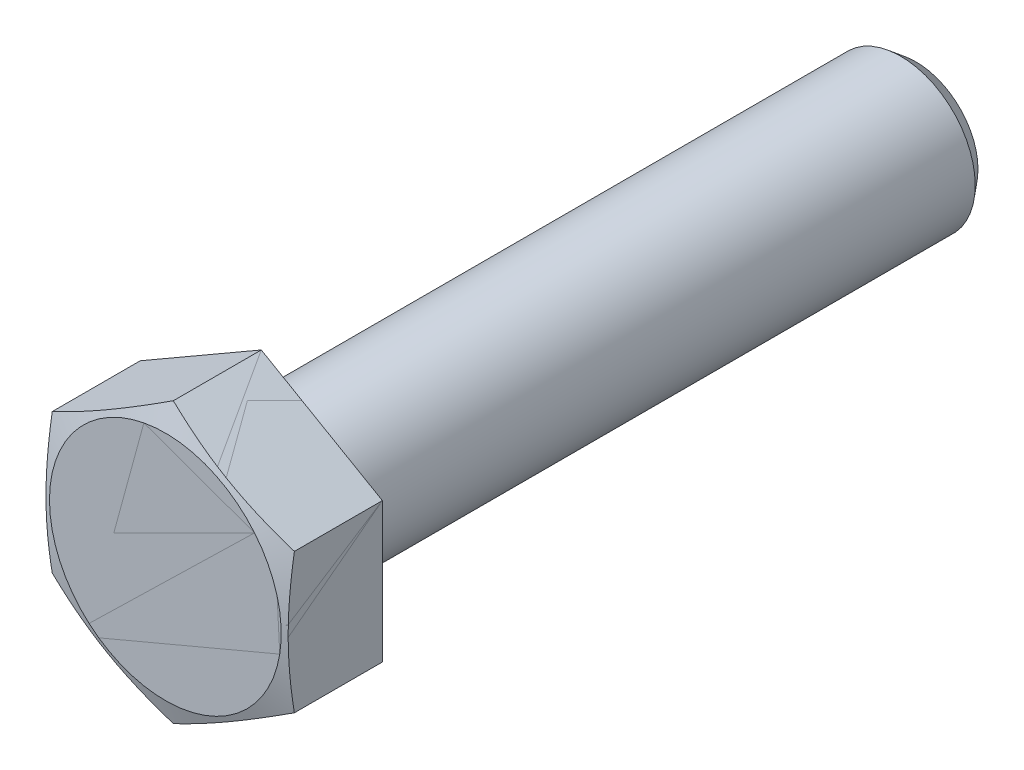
ISO-10303-21;
HEADER;
FILE_DESCRIPTION(('STEP AP214'),'2;1');
FILE_NAME('part.step','',(''),(''),'','','');
FILE_SCHEMA(('AUTOMOTIVE_DESIGN { 1 0 10303 214 1 1 1 1 }'));
ENDSEC;
DATA;
#1=APPLICATION_CONTEXT('core data for automotive mechanical design processes');
#2=APPLICATION_PROTOCOL_DEFINITION('international standard','automotive_design',2000,#1);
#3=PRODUCT_CONTEXT('',#1,'mechanical');
#4=PRODUCT('Part','Part','',(#3));
#5=PRODUCT_RELATED_PRODUCT_CATEGORY('part','',(#4));
#6=PRODUCT_DEFINITION_FORMATION('','',#4);
#7=PRODUCT_DEFINITION_CONTEXT('part definition',#1,'design');
#8=PRODUCT_DEFINITION('design','',#6,#7);
#9=PRODUCT_DEFINITION_SHAPE('','',#8);
#10=(LENGTH_UNIT() NAMED_UNIT(*) SI_UNIT(.MILLI.,.METRE.));
#11=(NAMED_UNIT(*) PLANE_ANGLE_UNIT() SI_UNIT($,.RADIAN.));
#12=(NAMED_UNIT(*) SI_UNIT($,.STERADIAN.) SOLID_ANGLE_UNIT());
#13=UNCERTAINTY_MEASURE_WITH_UNIT(LENGTH_MEASURE(1.E-05),#10,'distance_accuracy_value','');
#14=(GEOMETRIC_REPRESENTATION_CONTEXT(3) GLOBAL_UNCERTAINTY_ASSIGNED_CONTEXT((#13)) GLOBAL_UNIT_ASSIGNED_CONTEXT((#10,
#11,#12)) REPRESENTATION_CONTEXT('',''));
#15=CARTESIAN_POINT('',(0.,0.,0.));
#16=DIRECTION('',(0.,0.,1.));
#17=DIRECTION('',(1.,0.,0.));
#18=AXIS2_PLACEMENT_3D('',#15,#16,#17);
#19=CARTESIAN_POINT('',(0.,0.,0.15));
#20=DIRECTION('',(0.,0.,1.));
#21=DIRECTION('',(1.,0.,0.));
#22=AXIS2_PLACEMENT_3D('',#19,#20,#21);
#23=TOROIDAL_SURFACE('',#22,5.65,0.15);
#24=CARTESIAN_POINT('',(0.,0.,0.15));
#25=DIRECTION('',(0.,0.,1.));
#26=DIRECTION('',(1.,0.,0.));
#27=AXIS2_PLACEMENT_3D('',#24,#25,#26);
#28=CIRCLE('',#27,5.8);
#29=CARTESIAN_POINT('',(5.8,0.,0.15));
#30=VERTEX_POINT('',#29);
#31=EDGE_CURVE('P0_E11',#30,#30,#28,.T.);
#32=ORIENTED_EDGE('',*,*,#31,.F.);
#33=EDGE_LOOP('',(#32));
#34=FACE_BOUND('',#33,.T.);
#35=CARTESIAN_POINT('',(0.,0.,0.));
#36=DIRECTION('',(0.,0.,1.));
#37=DIRECTION('',(1.,0.,0.));
#38=AXIS2_PLACEMENT_3D('',#35,#36,#37);
#39=CIRCLE('',#38,5.65);
#40=CARTESIAN_POINT('',(5.65,0.,0.));
#41=VERTEX_POINT('',#40);
#42=EDGE_CURVE('P0_E33',#41,#41,#39,.T.);
#43=ORIENTED_EDGE('',*,*,#42,.T.);
#44=EDGE_LOOP('',(#43));
#45=FACE_BOUND('',#44,.T.);
#46=ADVANCED_FACE('P0_F26',(#34,#45),#23,.T.);
#47=CARTESIAN_POINT('',(0.,5.65,0.));
#48=DIRECTION('',(0.,0.,-1.));
#49=DIRECTION('',(-1.,0.,0.));
#50=AXIS2_PLACEMENT_3D('',#47,#48,#49);
#51=PLANE('',#50);
#52=CARTESIAN_POINT('',(0.,0.,0.));
#53=DIRECTION('',(0.,0.,1.));
#54=DIRECTION('',(1.,0.,0.));
#55=AXIS2_PLACEMENT_3D('',#52,#53,#54);
#56=CIRCLE('',#55,4.4);
#57=CARTESIAN_POINT('',(4.4,0.,0.));
#58=VERTEX_POINT('',#57);
#59=EDGE_CURVE('P0_E118',#58,#58,#56,.T.);
#60=ORIENTED_EDGE('',*,*,#59,.T.);
#61=EDGE_LOOP('',(#60));
#62=FACE_BOUND('',#61,.T.);
#63=ORIENTED_EDGE('',*,*,#42,.F.);
#64=EDGE_LOOP('',(#63));
#65=FACE_BOUND('',#64,.T.);
#66=ADVANCED_FACE('P0_F124',(#62,#65),#51,.T.);
#67=CARTESIAN_POINT('',(0.,0.,-0.4));
#68=DIRECTION('',(0.,0.,1.));
#69=DIRECTION('',(1.,0.,0.));
#70=AXIS2_PLACEMENT_3D('',#67,#68,#69);
#71=TOROIDAL_SURFACE('',#70,4.4,0.4);
#72=CARTESIAN_POINT('',(0.,0.,-0.4));
#73=DIRECTION('',(0.,0.,1.));
#74=DIRECTION('',(1.,0.,0.));
#75=AXIS2_PLACEMENT_3D('',#72,#73,#74);
#76=CIRCLE('',#75,4.);
#77=CARTESIAN_POINT('',(4.,0.,-0.4));
#78=VERTEX_POINT('',#77);
#79=EDGE_CURVE('P0_E115',#78,#78,#76,.T.);
#80=ORIENTED_EDGE('',*,*,#79,.T.);
#81=EDGE_LOOP('',(#80));
#82=FACE_BOUND('',#81,.T.);
#83=ORIENTED_EDGE('',*,*,#59,.F.);
#84=EDGE_LOOP('',(#83));
#85=FACE_BOUND('',#84,.T.);
#86=ADVANCED_FACE('P0_F126',(#82,#85),#71,.F.);
#87=CARTESIAN_POINT('',(-6.5,-3.752775,0.15));
#88=DIRECTION('',(0.,0.,-1.));
#89=DIRECTION('',(-1.,0.,0.));
#90=AXIS2_PLACEMENT_3D('',#87,#88,#89);
#91=PLANE('',#90);
#92=DIRECTION('',(0.,-1.,0.));
#93=VECTOR('',#92,1.);
#94=CARTESIAN_POINT('',(-6.5,3.752775,0.15));
#95=LINE('',#94,#93);
#96=CARTESIAN_POINT('',(-6.5,3.752775,0.15));
#97=VERTEX_POINT('',#96);
#98=CARTESIAN_POINT('',(-6.5,-3.752775,0.15));
#99=VERTEX_POINT('',#98);
#100=EDGE_CURVE('P0_E92',#97,#99,#95,.T.);
#101=ORIENTED_EDGE('',*,*,#100,.F.);
#102=DIRECTION('',(0.866025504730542,0.499999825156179,0.));
#103=VECTOR('',#102,1.);
#104=CARTESIAN_POINT('',(-6.5,3.752775,0.15));
#105=LINE('',#104,#103);
#106=CARTESIAN_POINT('',(0.,7.50555,0.15));
#107=VERTEX_POINT('',#106);
#108=EDGE_CURVE('P0_E97',#97,#107,#105,.T.);
#109=ORIENTED_EDGE('',*,*,#108,.T.);
#110=DIRECTION('',(0.866025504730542,-0.499999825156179,0.));
#111=VECTOR('',#110,1.);
#112=CARTESIAN_POINT('',(0.,7.50555,0.15));
#113=LINE('',#112,#111);
#114=CARTESIAN_POINT('',(6.5,3.752775,0.15));
#115=VERTEX_POINT('',#114);
#116=EDGE_CURVE('P0_E103',#107,#115,#113,.T.);
#117=ORIENTED_EDGE('',*,*,#116,.T.);
#118=DIRECTION('',(0.,-1.,0.));
#119=VECTOR('',#118,1.);
#120=CARTESIAN_POINT('',(6.5,3.752775,0.15));
#121=LINE('',#120,#119);
#122=CARTESIAN_POINT('',(6.5,-3.752775,0.15));
#123=VERTEX_POINT('',#122);
#124=EDGE_CURVE('P0_E233',#115,#123,#121,.T.);
#125=ORIENTED_EDGE('',*,*,#124,.T.);
#126=DIRECTION('',(-0.866025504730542,-0.499999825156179,0.));
#127=VECTOR('',#126,1.);
#128=CARTESIAN_POINT('',(6.5,-3.752775,0.15));
#129=LINE('',#128,#127);
#130=CARTESIAN_POINT('',(0.,-7.50555,0.15));
#131=VERTEX_POINT('',#130);
#132=EDGE_CURVE('P0_E219',#123,#131,#129,.T.);
#133=ORIENTED_EDGE('',*,*,#132,.T.);
#134=DIRECTION('',(-0.866025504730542,0.499999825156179,0.));
#135=VECTOR('',#134,1.);
#136=CARTESIAN_POINT('',(0.,-7.50555,0.15));
#137=LINE('',#136,#135);
#138=EDGE_CURVE('P0_E217',#131,#99,#137,.T.);
#139=ORIENTED_EDGE('',*,*,#138,.T.);
#140=EDGE_LOOP('',(#101,#109,#117,#125,#133,#139));
#141=FACE_BOUND('',#140,.T.);
#142=ORIENTED_EDGE('',*,*,#31,.T.);
#143=EDGE_LOOP('',(#142));
#144=FACE_BOUND('',#143,.T.);
#145=ADVANCED_FACE('P0_F132',(#141,#144),#91,.T.);
#146=CARTESIAN_POINT('',(-6.5,3.752775,0.15));
#147=DIRECTION('',(-1.,0.,0.));
#148=DIRECTION('',(0.,0.,1.));
#149=AXIS2_PLACEMENT_3D('',#146,#147,#148);
#150=PLANE('',#149);
#151=CARTESIAN_POINT('',(-6.5,-9.92768465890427,3.42219076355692));
#152=CARTESIAN_POINT('',(-6.5,-9.63320200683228,3.50410507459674));
#153=CARTESIAN_POINT('',(-6.5,-9.33844353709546,3.58504584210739));
#154=CARTESIAN_POINT('',(-6.5,-8.74823643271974,3.74444577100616));
#155=CARTESIAN_POINT('',(-6.5,-8.45278775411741,3.82290476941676));
#156=CARTESIAN_POINT('',(-6.5,-7.86064924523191,3.97691306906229));
#157=CARTESIAN_POINT('',(-6.5,-7.56395820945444,4.05245775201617));
#158=CARTESIAN_POINT('',(-6.5,-6.96964246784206,4.19977756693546));
#159=CARTESIAN_POINT('',(-6.5,-6.67201777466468,4.27155274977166));
#160=CARTESIAN_POINT('',(-6.5,-6.07920080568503,4.40958972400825));
#161=CARTESIAN_POINT('',(-6.5,-5.78402145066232,4.47590673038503));
#162=CARTESIAN_POINT('',(-6.5,-5.19244039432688,4.60283348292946));
#163=CARTESIAN_POINT('',(-6.5,-4.89603873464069,4.66344342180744));
#164=CARTESIAN_POINT('',(-6.5,-4.30192301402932,4.77756540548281));
#165=CARTESIAN_POINT('',(-6.5,-4.00420923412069,4.83107890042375));
#166=CARTESIAN_POINT('',(-6.5,-3.4073313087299,4.92939310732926));
#167=CARTESIAN_POINT('',(-6.5,-3.10816717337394,4.9741938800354));
#168=CARTESIAN_POINT('',(-6.5,-2.51584786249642,5.05231938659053));
#169=CARTESIAN_POINT('',(-6.5,-2.22272695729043,5.08590043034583));
#170=CARTESIAN_POINT('',(-6.5,-1.6353790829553,5.14147194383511));
#171=CARTESIAN_POINT('',(-6.5,-1.34115215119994,5.16346280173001));
#172=CARTESIAN_POINT('',(-6.5,-0.752211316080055,5.19459534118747));
#173=CARTESIAN_POINT('',(-6.5,-0.457497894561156,5.20374596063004));
#174=CARTESIAN_POINT('',(-6.5,0.132041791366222,5.20865235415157));
#175=CARTESIAN_POINT('',(-6.5,0.426868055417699,5.20440817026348));
#176=CARTESIAN_POINT('',(-6.5,1.01755930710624,5.18273935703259));
#177=CARTESIAN_POINT('',(-6.5,1.31342173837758,5.16524639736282));
#178=CARTESIAN_POINT('',(-6.5,1.90416213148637,5.11804868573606));
#179=CARTESIAN_POINT('',(-6.5,2.19904006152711,5.08834354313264));
#180=CARTESIAN_POINT('',(-6.5,2.78778899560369,5.01822295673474));
#181=CARTESIAN_POINT('',(-6.5,3.08165875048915,4.97779718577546));
#182=CARTESIAN_POINT('',(-6.5,3.66800309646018,4.88794282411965));
#183=CARTESIAN_POINT('',(-6.5,3.96047768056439,4.83851418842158));
#184=CARTESIAN_POINT('',(-6.5,4.53383951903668,4.734123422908));
#185=CARTESIAN_POINT('',(-6.5,4.81477360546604,4.67941596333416));
#186=CARTESIAN_POINT('',(-6.5,5.37549299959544,4.56437238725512));
#187=CARTESIAN_POINT('',(-6.5,5.65527825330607,4.50403600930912));
#188=CARTESIAN_POINT('',(-6.5,6.21386077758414,4.3787797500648));
#189=CARTESIAN_POINT('',(-6.5,6.49265788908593,4.31385916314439));
#190=CARTESIAN_POINT('',(-6.5,7.0493618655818,4.18029589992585));
#191=CARTESIAN_POINT('',(-6.5,7.3272687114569,4.11165314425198));
#192=CARTESIAN_POINT('',(-6.5,7.88244293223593,3.97129958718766));
#193=CARTESIAN_POINT('',(-6.5,8.159709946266,3.89958736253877));
#194=CARTESIAN_POINT('',(-6.5,8.71358713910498,3.75366585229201));
#195=CARTESIAN_POINT('',(-6.5,8.99019731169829,3.67945654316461));
#196=CARTESIAN_POINT('',(-6.5,9.81912857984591,3.45377511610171));
#197=CARTESIAN_POINT('',(-6.5,10.3706135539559,3.29923331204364));
#198=CARTESIAN_POINT('',(-6.5,11.4645427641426,2.98659237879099));
#199=CARTESIAN_POINT('',(-6.5,12.0070088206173,2.82856906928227));
#200=CARTESIAN_POINT('',(-6.5,13.090775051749,2.5085206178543));
#201=CARTESIAN_POINT('',(-6.5,13.6320751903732,2.34649535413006));
#202=CARTESIAN_POINT('',(-6.5,14.7126438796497,2.01984553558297));
#203=CARTESIAN_POINT('',(-6.5,15.2519143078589,1.85522717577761));
#204=CARTESIAN_POINT('',(-6.5,16.3297306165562,1.52373570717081));
#205=CARTESIAN_POINT('',(-6.5,16.8682765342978,1.3568627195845));
#206=CARTESIAN_POINT('',(-6.5,17.4065709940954,1.18919184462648));
#207=B_SPLINE_CURVE_WITH_KNOTS('',3,(#151,#152,#153,#154,#155,#156,#157,#158,#159,#160,#161,
#162,#163,#164,#165,#166,#167,#168,#169,#170,#171,#172,#173,#174,#175,#176,#177,#178,#179,#180,
#181,#182,#183,#184,#185,#186,#187,#188,#189,#190,#191,#192,#193,#194,#195,#196,#197,#198,#199,
#200,#201,#202,#203,#204,#205,#206),.UNSPECIFIED.,.F.,.F.,(4,2,2,2,2,2,2,2,2,2,2,2,2,2,2,2,2,2,
2,2,2,2,2,2,2,2,2,4),(0.,0.916995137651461,1.83405036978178,2.75250368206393,3.67094459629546,
4.57851158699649,5.48604792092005,6.39339851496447,7.30074278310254,8.18565759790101,
9.07054277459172,9.95481169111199,10.8390778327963,11.7279358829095,12.616822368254,
13.5065682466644,14.3963185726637,15.2548833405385,16.1134880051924,16.9722251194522,
17.830980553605,18.6901385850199,19.5493047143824,21.2674414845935,22.9624656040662,
24.6575413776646,26.3490461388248,28.0404603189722),.UNSPECIFIED.);
#208=CARTESIAN_POINT('',(-6.5,3.752775,4.87245657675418));
#209=VERTEX_POINT('',#208);
#210=CARTESIAN_POINT('',(-6.5,-3.752775,4.87245657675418));
#211=VERTEX_POINT('',#210);
#212=EDGE_CURVE('P0_E81',#209,#211,#207,.F.);
#213=ORIENTED_EDGE('',*,*,#212,.F.);
#214=DIRECTION('',(0.,0.,1.));
#215=VECTOR('',#214,1.);
#216=CARTESIAN_POINT('',(-6.5,3.752775,0.15));
#217=LINE('',#216,#215);
#218=EDGE_CURVE('P0_E90',#97,#209,#217,.T.);
#219=ORIENTED_EDGE('',*,*,#218,.F.);
#220=ORIENTED_EDGE('',*,*,#100,.T.);
#221=DIRECTION('',(0.,0.,1.));
#222=VECTOR('',#221,1.);
#223=CARTESIAN_POINT('',(-6.5,-3.752775,0.15));
#224=LINE('',#223,#222);
#225=EDGE_CURVE('P0_E48',#99,#211,#224,.T.);
#226=ORIENTED_EDGE('',*,*,#225,.T.);
#227=EDGE_LOOP('',(#213,#219,#220,#226));
#228=FACE_BOUND('',#227,.T.);
#229=ADVANCED_FACE('P0_F88',(#228),#150,.T.);
#230=CARTESIAN_POINT('',(0.,-7.50555,0.15));
#231=DIRECTION('',(0.499999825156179,0.866025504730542,0.));
#232=DIRECTION('',(0.866025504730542,-0.499999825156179,0.));
#233=AXIS2_PLACEMENT_3D('',#230,#231,#232);
#234=PLANE('',#233);
#235=DIRECTION('',(0.,0.,1.));
#236=VECTOR('',#235,1.);
#237=CARTESIAN_POINT('',(0.,-7.50555,0.15));
#238=LINE('',#237,#236);
#239=CARTESIAN_POINT('',(0.,-7.50555,4.87245744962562));
#240=VERTEX_POINT('',#239);
#241=EDGE_CURVE('P0_E224',#131,#240,#238,.T.);
#242=ORIENTED_EDGE('',*,*,#241,.T.);
#243=CARTESIAN_POINT('',(2.00000000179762E-07,-7.50555011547,4.87245741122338));
#244=CARTESIAN_POINT('',(-0.269447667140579,-7.34998438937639,4.92421240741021));
#245=CARTESIAN_POINT('',(-0.539641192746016,-7.19398815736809,4.97125826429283));
#246=CARTESIAN_POINT('',(-1.08149605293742,-6.88114825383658,5.05398662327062));
#247=CARTESIAN_POINT('',(-1.35315821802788,-6.7243041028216,5.0896618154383));
#248=CARTESIAN_POINT('',(-1.89542621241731,-6.41122567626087,5.14740289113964));
#249=CARTESIAN_POINT('',(-2.16602338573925,-6.25499639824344,5.16957424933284));
#250=CARTESIAN_POINT('',(-2.7077471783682,-5.94223216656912,5.19930920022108));
#251=CARTESIAN_POINT('',(-2.97887360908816,-5.78569732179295,5.20687728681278));
#252=CARTESIAN_POINT('',(-3.52112646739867,-5.47262763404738,5.2068772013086));
#253=CARTESIAN_POINT('',(-3.79225289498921,-5.31609279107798,5.19930902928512));
#254=CARTESIAN_POINT('',(-4.33397667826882,-5.00332856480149,5.16957391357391));
#255=CARTESIAN_POINT('',(-4.60457384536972,-4.84709929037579,5.14740247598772));
#256=CARTESIAN_POINT('',(-5.14684182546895,-4.5340208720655,5.08966125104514));
#257=CARTESIAN_POINT('',(-5.41850398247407,-4.37717672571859,5.05398598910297));
#258=CARTESIAN_POINT('',(-5.96035882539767,-4.06433683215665,4.97125750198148));
#259=CARTESIAN_POINT('',(-6.23055234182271,-3.90834060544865,4.92421158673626));
#260=CARTESIAN_POINT('',(-6.5000002,-3.75277488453,4.87245653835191));
#261=B_SPLINE_CURVE_WITH_KNOTS('',3,(#243,#244,#245,#246,#247,#248,#249,#250,#251,#252,#253,
#254,#255,#256,#257,#258,#259,#260),.UNSPECIFIED.,.F.,.F.,(4,2,2,2,2,2,2,2,4),(0.,
0.946299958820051,1.89320704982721,2.83261995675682,3.7717437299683,4.71086749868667,
5.65028040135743,6.59718748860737,7.54348744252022),.UNSPECIFIED.);
#262=EDGE_CURVE('P0_E93',#240,#211,#261,.T.);
#263=ORIENTED_EDGE('',*,*,#262,.T.);
#264=ORIENTED_EDGE('',*,*,#225,.F.);
#265=ORIENTED_EDGE('',*,*,#138,.F.);
#266=EDGE_LOOP('',(#242,#263,#264,#265));
#267=FACE_BOUND('',#266,.T.);
#268=ADVANCED_FACE('P0_F153',(#267),#234,.F.);
#269=CARTESIAN_POINT('',(6.5,-3.752775,0.15));
#270=DIRECTION('',(-0.499999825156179,0.866025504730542,0.));
#271=DIRECTION('',(0.866025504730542,0.499999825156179,0.));
#272=AXIS2_PLACEMENT_3D('',#269,#270,#271);
#273=PLANE('',#272);
#274=DIRECTION('',(0.,0.,1.));
#275=VECTOR('',#274,1.);
#276=CARTESIAN_POINT('',(6.5,-3.752775,0.15));
#277=LINE('',#276,#275);
#278=CARTESIAN_POINT('',(6.5,-3.752775,4.87245657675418));
#279=VERTEX_POINT('',#278);
#280=EDGE_CURVE('P0_E227',#123,#279,#277,.T.);
#281=ORIENTED_EDGE('',*,*,#280,.T.);
#282=CARTESIAN_POINT('',(6.5000002,-3.75277488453,4.87245653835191));
#283=CARTESIAN_POINT('',(6.23055234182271,-3.90834060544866,4.92421158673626));
#284=CARTESIAN_POINT('',(5.96035882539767,-4.06433683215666,4.97125750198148));
#285=CARTESIAN_POINT('',(5.41850398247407,-4.37717672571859,5.05398598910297));
#286=CARTESIAN_POINT('',(5.14684182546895,-4.5340208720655,5.08966125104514));
#287=CARTESIAN_POINT('',(4.60457384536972,-4.84709929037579,5.14740247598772));
#288=CARTESIAN_POINT('',(4.33397667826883,-5.00332856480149,5.16957391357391));
#289=CARTESIAN_POINT('',(3.79225289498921,-5.31609279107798,5.19930902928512));
#290=CARTESIAN_POINT('',(3.52112646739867,-5.47262763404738,5.20687720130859));
#291=CARTESIAN_POINT('',(2.97887360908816,-5.78569732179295,5.20687728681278));
#292=CARTESIAN_POINT('',(2.7077471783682,-5.94223216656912,5.19930920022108));
#293=CARTESIAN_POINT('',(2.16602338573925,-6.25499639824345,5.16957424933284));
#294=CARTESIAN_POINT('',(1.89542621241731,-6.41122567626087,5.14740289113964));
#295=CARTESIAN_POINT('',(1.35315821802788,-6.72430410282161,5.0896618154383));
#296=CARTESIAN_POINT('',(1.08149605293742,-6.88114825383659,5.05398662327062));
#297=CARTESIAN_POINT('',(0.539641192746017,-7.19398815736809,4.97125826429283));
#298=CARTESIAN_POINT('',(0.269447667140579,-7.34998438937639,4.92421240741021));
#299=CARTESIAN_POINT('',(-2.00000001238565E-07,-7.50555011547,4.87245741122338));
#300=B_SPLINE_CURVE_WITH_KNOTS('',3,(#282,#283,#284,#285,#286,#287,#288,#289,#290,#291,#292,
#293,#294,#295,#296,#297,#298,#299),.UNSPECIFIED.,.F.,.F.,(4,2,2,2,2,2,2,2,4),(0.,
0.94629995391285,1.89320704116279,2.83261994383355,3.77174371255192,4.7108674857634,
5.65028039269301,6.59718748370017,7.54348744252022),.UNSPECIFIED.);
#301=EDGE_CURVE('P0_E190',#279,#240,#300,.T.);
#302=ORIENTED_EDGE('',*,*,#301,.T.);
#303=ORIENTED_EDGE('',*,*,#241,.F.);
#304=ORIENTED_EDGE('',*,*,#132,.F.);
#305=EDGE_LOOP('',(#281,#302,#303,#304));
#306=FACE_BOUND('',#305,.T.);
#307=ADVANCED_FACE('P0_F195',(#306),#273,.F.);
#308=CARTESIAN_POINT('',(6.5,3.752775,0.15));
#309=DIRECTION('',(-1.,0.,0.));
#310=DIRECTION('',(0.,0.,1.));
#311=AXIS2_PLACEMENT_3D('',#308,#309,#310);
#312=PLANE('',#311);
#313=DIRECTION('',(0.,0.,1.));
#314=VECTOR('',#313,1.);
#315=CARTESIAN_POINT('',(6.5,3.752775,0.15));
#316=LINE('',#315,#314);
#317=CARTESIAN_POINT('',(6.5,3.752775,4.87245657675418));
#318=VERTEX_POINT('',#317);
#319=EDGE_CURVE('P0_E101',#115,#318,#316,.T.);
#320=ORIENTED_EDGE('',*,*,#319,.T.);
#321=CARTESIAN_POINT('',(6.5,-9.92768465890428,3.42219076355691));
#322=CARTESIAN_POINT('',(6.5,-9.63320200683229,3.50410507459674));
#323=CARTESIAN_POINT('',(6.5,-9.33844353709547,3.58504584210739));
#324=CARTESIAN_POINT('',(6.5,-8.74823643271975,3.74444577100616));
#325=CARTESIAN_POINT('',(6.5,-8.45278775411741,3.82290476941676));
#326=CARTESIAN_POINT('',(6.5,-7.86064924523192,3.97691306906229));
#327=CARTESIAN_POINT('',(6.5,-7.56395820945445,4.05245775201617));
#328=CARTESIAN_POINT('',(6.5,-6.96964246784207,4.19977756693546));
#329=CARTESIAN_POINT('',(6.5,-6.67201777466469,4.27155274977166));
#330=CARTESIAN_POINT('',(6.5,-6.07920080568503,4.40958972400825));
#331=CARTESIAN_POINT('',(6.5,-5.78402145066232,4.47590673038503));
#332=CARTESIAN_POINT('',(6.5,-5.19244039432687,4.60283348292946));
#333=CARTESIAN_POINT('',(6.5,-4.89603873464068,4.66344342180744));
#334=CARTESIAN_POINT('',(6.5,-4.30192301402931,4.77756540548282));
#335=CARTESIAN_POINT('',(6.5,-4.00420923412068,4.83107890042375));
#336=CARTESIAN_POINT('',(6.5,-3.4073313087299,4.92939310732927));
#337=CARTESIAN_POINT('',(6.5,-3.10816717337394,4.97419388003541));
#338=CARTESIAN_POINT('',(6.5,-2.51584786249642,5.05231938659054));
#339=CARTESIAN_POINT('',(6.5,-2.22272695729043,5.08590043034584));
#340=CARTESIAN_POINT('',(6.5,-1.6353790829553,5.14147194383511));
#341=CARTESIAN_POINT('',(6.5,-1.34115215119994,5.16346280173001));
#342=CARTESIAN_POINT('',(6.5,-0.752211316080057,5.19459534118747));
#343=CARTESIAN_POINT('',(6.5,-0.457497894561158,5.20374596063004));
#344=CARTESIAN_POINT('',(6.5,0.132041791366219,5.20865235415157));
#345=CARTESIAN_POINT('',(6.5,0.426868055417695,5.20440817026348));
#346=CARTESIAN_POINT('',(6.5,1.01755930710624,5.18273935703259));
#347=CARTESIAN_POINT('',(6.5,1.31342173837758,5.16524639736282));
#348=CARTESIAN_POINT('',(6.5,1.90416213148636,5.11804868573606));
#349=CARTESIAN_POINT('',(6.5,2.19904006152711,5.08834354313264));
#350=CARTESIAN_POINT('',(6.5,2.78778899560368,5.01822295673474));
#351=CARTESIAN_POINT('',(6.5,3.08165875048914,4.97779718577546));
#352=CARTESIAN_POINT('',(6.5,3.66800309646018,4.88794282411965));
#353=CARTESIAN_POINT('',(6.5,3.96047768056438,4.83851418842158));
#354=CARTESIAN_POINT('',(6.5,4.53383951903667,4.734123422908));
#355=CARTESIAN_POINT('',(6.5,4.81477360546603,4.67941596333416));
#356=CARTESIAN_POINT('',(6.5,5.37549299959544,4.56437238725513));
#357=CARTESIAN_POINT('',(6.5,5.65527825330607,4.50403600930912));
#358=CARTESIAN_POINT('',(6.5,6.21386077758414,4.3787797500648));
#359=CARTESIAN_POINT('',(6.5,6.49265788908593,4.31385916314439));
#360=CARTESIAN_POINT('',(6.5,7.0493618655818,4.18029589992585));
#361=CARTESIAN_POINT('',(6.5,7.3272687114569,4.11165314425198));
#362=CARTESIAN_POINT('',(6.5,7.88244293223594,3.97129958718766));
#363=CARTESIAN_POINT('',(6.5,8.15970994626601,3.89958736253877));
#364=CARTESIAN_POINT('',(6.5,8.71358713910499,3.75366585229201));
#365=CARTESIAN_POINT('',(6.5,8.9901973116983,3.67945654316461));
#366=CARTESIAN_POINT('',(6.5,9.81912857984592,3.45377511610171));
#367=CARTESIAN_POINT('',(6.5,10.3706135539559,3.29923331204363));
#368=CARTESIAN_POINT('',(6.5,11.4645427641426,2.98659237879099));
#369=CARTESIAN_POINT('',(6.5,12.0070088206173,2.82856906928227));
#370=CARTESIAN_POINT('',(6.5,13.090775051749,2.5085206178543));
#371=CARTESIAN_POINT('',(6.5,13.6320751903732,2.34649535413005));
#372=CARTESIAN_POINT('',(6.5,14.7126438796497,2.01984553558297));
#373=CARTESIAN_POINT('',(6.5,15.2519143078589,1.85522717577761));
#374=CARTESIAN_POINT('',(6.5,16.3297306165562,1.52373570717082));
#375=CARTESIAN_POINT('',(6.5,16.8682765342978,1.3568627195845));
#376=CARTESIAN_POINT('',(6.5,17.4065709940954,1.18919184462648));
#377=B_SPLINE_CURVE_WITH_KNOTS('',3,(#321,#322,#323,#324,#325,#326,#327,#328,#329,#330,#331,
#332,#333,#334,#335,#336,#337,#338,#339,#340,#341,#342,#343,#344,#345,#346,#347,#348,#349,#350,
#351,#352,#353,#354,#355,#356,#357,#358,#359,#360,#361,#362,#363,#364,#365,#366,#367,#368,#369,
#370,#371,#372,#373,#374,#375,#376),.UNSPECIFIED.,.F.,.F.,(4,2,2,2,2,2,2,2,2,2,2,2,2,2,2,2,2,2,
2,2,2,2,2,2,2,2,2,4),(0.,0.916995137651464,1.83405036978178,2.75250368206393,3.67094459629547,
4.57851158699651,5.48604792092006,6.39339851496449,7.30074278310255,8.18565759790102,
9.07054277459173,9.954811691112,10.8390778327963,11.7279358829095,12.616822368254,
13.5065682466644,14.3963185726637,15.2548833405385,16.1134880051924,16.9722251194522,
17.830980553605,18.6901385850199,19.5493047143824,21.2674414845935,22.9624656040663,
24.6575413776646,26.3490461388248,28.0404603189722),.UNSPECIFIED.);
#378=EDGE_CURVE('P0_E185',#318,#279,#377,.F.);
#379=ORIENTED_EDGE('',*,*,#378,.T.);
#380=ORIENTED_EDGE('',*,*,#280,.F.);
#381=ORIENTED_EDGE('',*,*,#124,.F.);
#382=EDGE_LOOP('',(#320,#379,#380,#381));
#383=FACE_BOUND('',#382,.T.);
#384=ADVANCED_FACE('P0_F198',(#383),#312,.F.);
#385=CARTESIAN_POINT('',(0.,7.50555,0.15));
#386=DIRECTION('',(-0.499999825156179,-0.866025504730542,0.));
#387=DIRECTION('',(-0.866025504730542,0.499999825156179,0.));
#388=AXIS2_PLACEMENT_3D('',#385,#386,#387);
#389=PLANE('',#388);
#390=DIRECTION('',(0.,0.,1.));
#391=VECTOR('',#390,1.);
#392=CARTESIAN_POINT('',(0.,7.50555,0.15));
#393=LINE('',#392,#391);
#394=CARTESIAN_POINT('',(0.,7.50555,4.87245744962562));
#395=VERTEX_POINT('',#394);
#396=EDGE_CURVE('P0_E99',#107,#395,#393,.T.);
#397=ORIENTED_EDGE('',*,*,#396,.T.);
#398=CARTESIAN_POINT('',(-1.99999999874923E-07,7.50555011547,4.87245741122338));
#399=CARTESIAN_POINT('',(0.269447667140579,7.34998438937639,4.92421240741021));
#400=CARTESIAN_POINT('',(0.539641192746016,7.19398815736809,4.97125826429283));
#401=CARTESIAN_POINT('',(1.08149605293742,6.88114825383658,5.05398662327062));
#402=CARTESIAN_POINT('',(1.35315821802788,6.7243041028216,5.0896618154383));
#403=CARTESIAN_POINT('',(1.89542621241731,6.41122567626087,5.14740289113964));
#404=CARTESIAN_POINT('',(2.16602338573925,6.25499639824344,5.16957424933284));
#405=CARTESIAN_POINT('',(2.7077471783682,5.94223216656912,5.19930920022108));
#406=CARTESIAN_POINT('',(2.97887360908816,5.78569732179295,5.20687728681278));
#407=CARTESIAN_POINT('',(3.52112646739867,5.47262763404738,5.2068772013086));
#408=CARTESIAN_POINT('',(3.79225289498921,5.31609279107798,5.19930902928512));
#409=CARTESIAN_POINT('',(4.33397667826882,5.00332856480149,5.16957391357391));
#410=CARTESIAN_POINT('',(4.60457384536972,4.84709929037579,5.14740247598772));
#411=CARTESIAN_POINT('',(5.14684182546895,4.5340208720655,5.08966125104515));
#412=CARTESIAN_POINT('',(5.41850398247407,4.37717672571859,5.05398598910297));
#413=CARTESIAN_POINT('',(5.96035882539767,4.06433683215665,4.97125750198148));
#414=CARTESIAN_POINT('',(6.23055234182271,3.90834060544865,4.92421158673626));
#415=CARTESIAN_POINT('',(6.5000002,3.75277488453,4.87245653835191));
#416=B_SPLINE_CURVE_WITH_KNOTS('',3,(#398,#399,#400,#401,#402,#403,#404,#405,#406,#407,#408,
#409,#410,#411,#412,#413,#414,#415),.UNSPECIFIED.,.F.,.F.,(4,2,2,2,2,2,2,2,4),(0.,
0.946299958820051,1.89320704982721,2.83261995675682,3.7717437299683,4.71086749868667,
5.65028040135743,6.59718748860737,7.54348744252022),.UNSPECIFIED.);
#417=EDGE_CURVE('P0_E40',#395,#318,#416,.T.);
#418=ORIENTED_EDGE('',*,*,#417,.T.);
#419=ORIENTED_EDGE('',*,*,#319,.F.);
#420=ORIENTED_EDGE('',*,*,#116,.F.);
#421=EDGE_LOOP('',(#397,#418,#419,#420));
#422=FACE_BOUND('',#421,.T.);
#423=ADVANCED_FACE('P0_F202',(#422),#389,.F.);
#424=CARTESIAN_POINT('',(-6.5,3.752775,0.15));
#425=DIRECTION('',(0.499999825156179,-0.866025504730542,0.));
#426=DIRECTION('',(-0.866025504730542,-0.499999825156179,0.));
#427=AXIS2_PLACEMENT_3D('',#424,#425,#426);
#428=PLANE('',#427);
#429=ORIENTED_EDGE('',*,*,#218,.T.);
#430=CARTESIAN_POINT('',(-6.5000002,3.75277488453,4.8724565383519));
#431=CARTESIAN_POINT('',(-6.23055234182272,3.90834060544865,4.92421158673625));
#432=CARTESIAN_POINT('',(-5.96035882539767,4.06433683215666,4.97125750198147));
#433=CARTESIAN_POINT('',(-5.41850398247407,4.37717672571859,5.05398598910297));
#434=CARTESIAN_POINT('',(-5.14684182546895,4.5340208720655,5.08966125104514));
#435=CARTESIAN_POINT('',(-4.60457384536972,4.84709929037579,5.14740247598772));
#436=CARTESIAN_POINT('',(-4.33397667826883,5.00332856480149,5.16957391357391));
#437=CARTESIAN_POINT('',(-3.79225289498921,5.31609279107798,5.19930902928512));
#438=CARTESIAN_POINT('',(-3.52112646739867,5.47262763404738,5.20687720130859));
#439=CARTESIAN_POINT('',(-2.97887360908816,5.78569732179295,5.20687728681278));
#440=CARTESIAN_POINT('',(-2.7077471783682,5.94223216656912,5.19930920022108));
#441=CARTESIAN_POINT('',(-2.16602338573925,6.25499639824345,5.16957424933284));
#442=CARTESIAN_POINT('',(-1.89542621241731,6.41122567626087,5.14740289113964));
#443=CARTESIAN_POINT('',(-1.35315821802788,6.72430410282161,5.0896618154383));
#444=CARTESIAN_POINT('',(-1.08149605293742,6.88114825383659,5.05398662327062));
#445=CARTESIAN_POINT('',(-0.539641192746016,7.19398815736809,4.97125826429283));
#446=CARTESIAN_POINT('',(-0.269447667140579,7.34998438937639,4.92421240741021));
#447=CARTESIAN_POINT('',(2.00000001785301E-07,7.50555011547,4.87245741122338));
#448=B_SPLINE_CURVE_WITH_KNOTS('',3,(#430,#431,#432,#433,#434,#435,#436,#437,#438,#439,#440,
#441,#442,#443,#444,#445,#446,#447),.UNSPECIFIED.,.F.,.F.,(4,2,2,2,2,2,2,2,4),(0.,
0.946299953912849,1.89320704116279,2.83261994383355,3.77174371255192,4.7108674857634,
5.65028039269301,6.59718748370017,7.54348744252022),.UNSPECIFIED.);
#449=EDGE_CURVE('P0_E77',#209,#395,#448,.T.);
#450=ORIENTED_EDGE('',*,*,#449,.T.);
#451=ORIENTED_EDGE('',*,*,#396,.F.);
#452=ORIENTED_EDGE('',*,*,#108,.F.);
#453=EDGE_LOOP('',(#429,#450,#451,#452));
#454=FACE_BOUND('',#453,.T.);
#455=ADVANCED_FACE('P0_F95',(#454),#428,.F.);
#456=CARTESIAN_POINT('',(0.,0.,4.82253454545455));
#457=DIRECTION('',(0.,0.,-1.));
#458=DIRECTION('',(-1.,0.,0.));
#459=AXIS2_PLACEMENT_3D('',#456,#457,#458);
#460=CONICAL_SURFACE('',#459,7.655661,1.24972999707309);
#461=ORIENTED_EDGE('',*,*,#212,.T.);
#462=ORIENTED_EDGE('',*,*,#262,.F.);
#463=ORIENTED_EDGE('',*,*,#301,.F.);
#464=ORIENTED_EDGE('',*,*,#378,.F.);
#465=ORIENTED_EDGE('',*,*,#417,.F.);
#466=ORIENTED_EDGE('',*,*,#449,.F.);
#467=EDGE_LOOP('',(#461,#462,#463,#464,#465,#466));
#468=FACE_BOUND('',#467,.T.);
#469=CARTESIAN_POINT('',(0.,0.,5.3));
#470=DIRECTION('',(0.,0.,-1.));
#471=DIRECTION('',(-1.,0.,0.));
#472=AXIS2_PLACEMENT_3D('',#469,#470,#471);
#473=CIRCLE('',#472,6.21999097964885);
#474=CARTESIAN_POINT('',(-6.21999097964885,0.,5.3));
#475=VERTEX_POINT('',#474);
#476=EDGE_CURVE('P0_E85',#475,#475,#473,.F.);
#477=ORIENTED_EDGE('',*,*,#476,.F.);
#478=EDGE_LOOP('',(#477));
#479=FACE_BOUND('',#478,.T.);
#480=ADVANCED_FACE('P0_F79',(#468,#479),#460,.T.);
#481=CARTESIAN_POINT('',(-6.5,-3.752775,5.3));
#482=DIRECTION('',(0.,0.,-1.));
#483=DIRECTION('',(-1.,0.,0.));
#484=AXIS2_PLACEMENT_3D('',#481,#482,#483);
#485=PLANE('',#484);
#486=ORIENTED_EDGE('',*,*,#476,.T.);
#487=EDGE_LOOP('',(#486));
#488=FACE_BOUND('',#487,.T.);
#489=ADVANCED_FACE('P0_F148',(#488),#485,.F.);
#490=CARTESIAN_POINT('',(0.,3.3234375,-35.));
#491=DIRECTION('',(0.,0.,-1.));
#492=DIRECTION('',(-1.,0.,0.));
#493=AXIS2_PLACEMENT_3D('',#490,#491,#492);
#494=PLANE('',#493);
#495=CARTESIAN_POINT('',(0.,0.,-35.));
#496=DIRECTION('',(0.,0.,1.));
#497=DIRECTION('',(1.,0.,0.));
#498=AXIS2_PLACEMENT_3D('',#495,#496,#497);
#499=CIRCLE('',#498,3.3234375);
#500=CARTESIAN_POINT('',(3.3234375,0.,-35.));
#501=VERTEX_POINT('',#500);
#502=EDGE_CURVE('P0_E109',#501,#501,#499,.T.);
#503=ORIENTED_EDGE('',*,*,#502,.F.);
#504=EDGE_LOOP('',(#503));
#505=FACE_BOUND('',#504,.T.);
#506=ADVANCED_FACE('P0_F144',(#505),#494,.T.);
#507=CARTESIAN_POINT('',(0.,0.,-34.1734375));
#508=DIRECTION('',(0.,0.,1.));
#509=DIRECTION('',(1.,0.,0.));
#510=AXIS2_PLACEMENT_3D('',#507,#508,#509);
#511=CONICAL_SURFACE('',#510,4.,0.68593535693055);
#512=ORIENTED_EDGE('',*,*,#502,.T.);
#513=EDGE_LOOP('',(#512));
#514=FACE_BOUND('',#513,.T.);
#515=CARTESIAN_POINT('',(0.,0.,-34.1734375));
#516=DIRECTION('',(0.,0.,1.));
#517=DIRECTION('',(1.,0.,0.));
#518=AXIS2_PLACEMENT_3D('',#515,#516,#517);
#519=CIRCLE('',#518,4.);
#520=CARTESIAN_POINT('',(4.,0.,-34.1734375));
#521=VERTEX_POINT('',#520);
#522=EDGE_CURVE('P0_E112',#521,#521,#519,.T.);
#523=ORIENTED_EDGE('',*,*,#522,.F.);
#524=EDGE_LOOP('',(#523));
#525=FACE_BOUND('',#524,.T.);
#526=ADVANCED_FACE('P0_F140',(#514,#525),#511,.T.);
#527=CARTESIAN_POINT('',(0.,0.,0.15));
#528=DIRECTION('',(0.,0.,1.));
#529=DIRECTION('',(1.,0.,0.));
#530=AXIS2_PLACEMENT_3D('',#527,#528,#529);
#531=CYLINDRICAL_SURFACE('',#530,4.);
#532=ORIENTED_EDGE('',*,*,#522,.T.);
#533=EDGE_LOOP('',(#532));
#534=FACE_BOUND('',#533,.T.);
#535=ORIENTED_EDGE('',*,*,#79,.F.);
#536=EDGE_LOOP('',(#535));
#537=FACE_BOUND('',#536,.T.);
#538=ADVANCED_FACE('P0_F137',(#534,#537),#531,.T.);
#539=CLOSED_SHELL('',(#46,#66,#86,#145,#229,#268,#307,#384,#423,#455,#480,#489,#506,#526,#538));
#540=MANIFOLD_SOLID_BREP('P0_B2',#539);
#541=CARTESIAN_POINT('',(0.,0.,0.15));
#542=DIRECTION('',(0.,0.,1.));
#543=DIRECTION('',(1.,0.,0.));
#544=AXIS2_PLACEMENT_3D('',#541,#542,#543);
#545=TOROIDAL_SURFACE('',#544,5.65,0.15);
#546=CARTESIAN_POINT('',(0.,0.,0.15));
#547=DIRECTION('',(0.,0.,1.));
#548=DIRECTION('',(1.,0.,0.));
#549=AXIS2_PLACEMENT_3D('',#546,#547,#548);
#550=CIRCLE('',#549,5.8);
#551=CARTESIAN_POINT('',(5.8,0.,0.15));
#552=VERTEX_POINT('',#551);
#553=EDGE_CURVE('P1_E11',#552,#552,#550,.T.);
#554=ORIENTED_EDGE('',*,*,#553,.F.);
#555=EDGE_LOOP('',(#554));
#556=FACE_BOUND('',#555,.T.);
#557=CARTESIAN_POINT('',(0.,0.,0.));
#558=DIRECTION('',(0.,0.,1.));
#559=DIRECTION('',(1.,0.,0.));
#560=AXIS2_PLACEMENT_3D('',#557,#558,#559);
#561=CIRCLE('',#560,5.65);
#562=CARTESIAN_POINT('',(5.65,0.,0.));
#563=VERTEX_POINT('',#562);
#564=EDGE_CURVE('P1_E23',#563,#563,#561,.T.);
#565=ORIENTED_EDGE('',*,*,#564,.T.);
#566=EDGE_LOOP('',(#565));
#567=FACE_BOUND('',#566,.T.);
#568=ADVANCED_FACE('P1_F16',(#556,#567),#545,.T.);
#569=CARTESIAN_POINT('',(0.,5.65,0.));
#570=DIRECTION('',(0.,0.,-1.));
#571=DIRECTION('',(-1.,0.,0.));
#572=AXIS2_PLACEMENT_3D('',#569,#570,#571);
#573=PLANE('',#572);
#574=CARTESIAN_POINT('',(0.,0.,0.));
#575=DIRECTION('',(0.,0.,1.));
#576=DIRECTION('',(1.,0.,0.));
#577=AXIS2_PLACEMENT_3D('',#574,#575,#576);
#578=CIRCLE('',#577,4.4);
#579=CARTESIAN_POINT('',(4.4,0.,0.));
#580=VERTEX_POINT('',#579);
#581=EDGE_CURVE('P1_E117',#580,#580,#578,.T.);
#582=ORIENTED_EDGE('',*,*,#581,.T.);
#583=EDGE_LOOP('',(#582));
#584=FACE_BOUND('',#583,.T.);
#585=ORIENTED_EDGE('',*,*,#564,.F.);
#586=EDGE_LOOP('',(#585));
#587=FACE_BOUND('',#586,.T.);
#588=ADVANCED_FACE('P1_F123',(#584,#587),#573,.T.);
#589=CARTESIAN_POINT('',(0.,0.,-0.4));
#590=DIRECTION('',(0.,0.,1.));
#591=DIRECTION('',(1.,0.,0.));
#592=AXIS2_PLACEMENT_3D('',#589,#590,#591);
#593=TOROIDAL_SURFACE('',#592,4.4,0.4);
#594=CARTESIAN_POINT('',(0.,0.,-0.4));
#595=DIRECTION('',(0.,0.,1.));
#596=DIRECTION('',(1.,0.,0.));
#597=AXIS2_PLACEMENT_3D('',#594,#595,#596);
#598=CIRCLE('',#597,4.);
#599=CARTESIAN_POINT('',(4.,0.,-0.4));
#600=VERTEX_POINT('',#599);
#601=EDGE_CURVE('P1_E114',#600,#600,#598,.T.);
#602=ORIENTED_EDGE('',*,*,#601,.T.);
#603=EDGE_LOOP('',(#602));
#604=FACE_BOUND('',#603,.T.);
#605=ORIENTED_EDGE('',*,*,#581,.F.);
#606=EDGE_LOOP('',(#605));
#607=FACE_BOUND('',#606,.T.);
#608=ADVANCED_FACE('P1_F125',(#604,#607),#593,.F.);
#609=CARTESIAN_POINT('',(0.,0.,0.15));
#610=DIRECTION('',(0.,0.,1.));
#611=DIRECTION('',(1.,0.,0.));
#612=AXIS2_PLACEMENT_3D('',#609,#610,#611);
#613=CYLINDRICAL_SURFACE('',#612,4.);
#614=CARTESIAN_POINT('',(0.,0.,-1.37215937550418));
#615=DIRECTION('',(0.,0.,1.));
#616=DIRECTION('',(1.,0.,0.));
#617=AXIS2_PLACEMENT_3D('',#614,#615,#616);
#618=CIRCLE('',#617,4.);
#619=CARTESIAN_POINT('',(4.,0.,-1.37215937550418));
#620=VERTEX_POINT('',#619);
#621=EDGE_CURVE('P1_E111',#620,#620,#618,.T.);
#622=ORIENTED_EDGE('',*,*,#621,.T.);
#623=EDGE_LOOP('',(#622));
#624=FACE_BOUND('',#623,.T.);
#625=ORIENTED_EDGE('',*,*,#601,.F.);
#626=EDGE_LOOP('',(#625));
#627=FACE_BOUND('',#626,.T.);
#628=ADVANCED_FACE('P1_F132',(#624,#627),#613,.T.);
#629=CARTESIAN_POINT('',(0.,0.,-1.37215937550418));
#630=DIRECTION('',(0.,0.,1.));
#631=DIRECTION('',(1.,0.,0.));
#632=AXIS2_PLACEMENT_3D('',#629,#630,#631);
#633=CONICAL_SURFACE('',#632,4.,0.523598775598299);
#634=CARTESIAN_POINT('',(0.,0.,-2.544));
#635=DIRECTION('',(0.,0.,1.));
#636=DIRECTION('',(1.,0.,0.));
#637=AXIS2_PLACEMENT_3D('',#634,#635,#636);
#638=CIRCLE('',#637,3.3234375);
#639=CARTESIAN_POINT('',(3.3234375,0.,-2.544));
#640=VERTEX_POINT('',#639);
#641=EDGE_CURVE('P1_E108',#640,#640,#638,.T.);
#642=ORIENTED_EDGE('',*,*,#641,.T.);
#643=EDGE_LOOP('',(#642));
#644=FACE_BOUND('',#643,.T.);
#645=ORIENTED_EDGE('',*,*,#621,.F.);
#646=EDGE_LOOP('',(#645));
#647=FACE_BOUND('',#646,.T.);
#648=ADVANCED_FACE('P1_F139',(#644,#647),#633,.T.);
#649=CARTESIAN_POINT('',(0.,3.3234375,-2.544));
#650=DIRECTION('',(0.,0.,1.));
#651=DIRECTION('',(1.,0.,0.));
#652=AXIS2_PLACEMENT_3D('',#649,#650,#651);
#653=PLANE('',#652);
#654=CARTESIAN_POINT('',(0.,0.,-2.544));
#655=DIRECTION('',(0.,0.,1.));
#656=DIRECTION('',(1.,0.,0.));
#657=AXIS2_PLACEMENT_3D('',#654,#655,#656);
#658=CIRCLE('',#657,4.);
#659=CARTESIAN_POINT('',(4.,0.,-2.544));
#660=VERTEX_POINT('',#659);
#661=EDGE_CURVE('P1_E105',#660,#660,#658,.T.);
#662=ORIENTED_EDGE('',*,*,#661,.T.);
#663=EDGE_LOOP('',(#662));
#664=FACE_BOUND('',#663,.T.);
#665=ORIENTED_EDGE('',*,*,#641,.F.);
#666=EDGE_LOOP('',(#665));
#667=FACE_BOUND('',#666,.T.);
#668=ADVANCED_FACE('P1_F143',(#664,#667),#653,.T.);
#669=CARTESIAN_POINT('',(0.,0.,0.15));
#670=DIRECTION('',(0.,0.,1.));
#671=DIRECTION('',(1.,0.,0.));
#672=AXIS2_PLACEMENT_3D('',#669,#670,#671);
#673=CYLINDRICAL_SURFACE('',#672,4.);
#674=CARTESIAN_POINT('',(0.,0.,-34.1734375));
#675=DIRECTION('',(0.,0.,1.));
#676=DIRECTION('',(1.,0.,0.));
#677=AXIS2_PLACEMENT_3D('',#674,#675,#676);
#678=CIRCLE('',#677,4.);
#679=CARTESIAN_POINT('',(4.,0.,-34.1734375));
#680=VERTEX_POINT('',#679);
#681=EDGE_CURVE('P1_E102',#680,#680,#678,.T.);
#682=ORIENTED_EDGE('',*,*,#681,.T.);
#683=EDGE_LOOP('',(#682));
#684=FACE_BOUND('',#683,.T.);
#685=ORIENTED_EDGE('',*,*,#661,.F.);
#686=EDGE_LOOP('',(#685));
#687=FACE_BOUND('',#686,.T.);
#688=ADVANCED_FACE('P1_F147',(#684,#687),#673,.T.);
#689=CARTESIAN_POINT('',(0.,0.,-34.1734375));
#690=DIRECTION('',(0.,0.,1.));
#691=DIRECTION('',(1.,0.,0.));
#692=AXIS2_PLACEMENT_3D('',#689,#690,#691);
#693=CONICAL_SURFACE('',#692,4.,0.68593535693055);
#694=CARTESIAN_POINT('',(0.,0.,-35.));
#695=DIRECTION('',(0.,0.,1.));
#696=DIRECTION('',(1.,0.,0.));
#697=AXIS2_PLACEMENT_3D('',#694,#695,#696);
#698=CIRCLE('',#697,3.3234375);
#699=CARTESIAN_POINT('',(3.3234375,0.,-35.));
#700=VERTEX_POINT('',#699);
#701=EDGE_CURVE('P1_E99',#700,#700,#698,.T.);
#702=ORIENTED_EDGE('',*,*,#701,.T.);
#703=EDGE_LOOP('',(#702));
#704=FACE_BOUND('',#703,.T.);
#705=ORIENTED_EDGE('',*,*,#681,.F.);
#706=EDGE_LOOP('',(#705));
#707=FACE_BOUND('',#706,.T.);
#708=ADVANCED_FACE('P1_F151',(#704,#707),#693,.T.);
#709=CARTESIAN_POINT('',(0.,3.3234375,-35.));
#710=DIRECTION('',(0.,0.,-1.));
#711=DIRECTION('',(-1.,0.,0.));
#712=AXIS2_PLACEMENT_3D('',#709,#710,#711);
#713=PLANE('',#712);
#714=ORIENTED_EDGE('',*,*,#701,.F.);
#715=EDGE_LOOP('',(#714));
#716=FACE_BOUND('',#715,.T.);
#717=ADVANCED_FACE('P1_F155',(#716),#713,.T.);
#718=CARTESIAN_POINT('',(-6.5,-3.752775,0.15));
#719=DIRECTION('',(0.,0.,-1.));
#720=DIRECTION('',(-1.,0.,0.));
#721=AXIS2_PLACEMENT_3D('',#718,#719,#720);
#722=PLANE('',#721);
#723=DIRECTION('',(0.,-1.,0.));
#724=VECTOR('',#723,1.);
#725=CARTESIAN_POINT('',(-6.5,3.752775,0.15));
#726=LINE('',#725,#724);
#727=CARTESIAN_POINT('',(-6.5,3.752775,0.15));
#728=VERTEX_POINT('',#727);
#729=CARTESIAN_POINT('',(-6.5,-3.752775,0.15));
#730=VERTEX_POINT('',#729);
#731=EDGE_CURVE('P1_E82',#728,#730,#726,.T.);
#732=ORIENTED_EDGE('',*,*,#731,.F.);
#733=DIRECTION('',(0.866025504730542,0.499999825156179,0.));
#734=VECTOR('',#733,1.);
#735=CARTESIAN_POINT('',(-6.5,3.752775,0.15));
#736=LINE('',#735,#734);
#737=CARTESIAN_POINT('',(0.,7.50555,0.15));
#738=VERTEX_POINT('',#737);
#739=EDGE_CURVE('P1_E87',#728,#738,#736,.T.);
#740=ORIENTED_EDGE('',*,*,#739,.T.);
#741=DIRECTION('',(0.866025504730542,-0.499999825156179,0.));
#742=VECTOR('',#741,1.);
#743=CARTESIAN_POINT('',(0.,7.50555,0.15));
#744=LINE('',#743,#742);
#745=CARTESIAN_POINT('',(6.5,3.752775,0.15));
#746=VERTEX_POINT('',#745);
#747=EDGE_CURVE('P1_E93',#738,#746,#744,.T.);
#748=ORIENTED_EDGE('',*,*,#747,.T.);
#749=DIRECTION('',(0.,-1.,0.));
#750=VECTOR('',#749,1.);
#751=CARTESIAN_POINT('',(6.5,3.752775,0.15));
#752=LINE('',#751,#750);
#753=CARTESIAN_POINT('',(6.5,-3.752775,0.15));
#754=VERTEX_POINT('',#753);
#755=EDGE_CURVE('P1_E245',#746,#754,#752,.T.);
#756=ORIENTED_EDGE('',*,*,#755,.T.);
#757=DIRECTION('',(-0.866025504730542,-0.499999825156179,0.));
#758=VECTOR('',#757,1.);
#759=CARTESIAN_POINT('',(6.5,-3.752775,0.15));
#760=LINE('',#759,#758);
#761=CARTESIAN_POINT('',(0.,-7.50555,0.15));
#762=VERTEX_POINT('',#761);
#763=EDGE_CURVE('P1_E231',#754,#762,#760,.T.);
#764=ORIENTED_EDGE('',*,*,#763,.T.);
#765=DIRECTION('',(-0.866025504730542,0.499999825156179,0.));
#766=VECTOR('',#765,1.);
#767=CARTESIAN_POINT('',(0.,-7.50555,0.15));
#768=LINE('',#767,#766);
#769=EDGE_CURVE('P1_E229',#762,#730,#768,.T.);
#770=ORIENTED_EDGE('',*,*,#769,.T.);
#771=EDGE_LOOP('',(#732,#740,#748,#756,#764,#770));
#772=FACE_BOUND('',#771,.T.);
#773=ORIENTED_EDGE('',*,*,#553,.T.);
#774=EDGE_LOOP('',(#773));
#775=FACE_BOUND('',#774,.T.);
#776=ADVANCED_FACE('P1_F159',(#772,#775),#722,.T.);
#777=CARTESIAN_POINT('',(-6.5,3.752775,0.15));
#778=DIRECTION('',(-1.,0.,0.));
#779=DIRECTION('',(0.,0.,1.));
#780=AXIS2_PLACEMENT_3D('',#777,#778,#779);
#781=PLANE('',#780);
#782=CARTESIAN_POINT('',(-6.5,-9.92768465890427,3.42219076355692));
#783=CARTESIAN_POINT('',(-6.5,-9.63320200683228,3.50410507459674));
#784=CARTESIAN_POINT('',(-6.5,-9.33844353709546,3.58504584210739));
#785=CARTESIAN_POINT('',(-6.5,-8.74823643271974,3.74444577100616));
#786=CARTESIAN_POINT('',(-6.5,-8.45278775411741,3.82290476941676));
#787=CARTESIAN_POINT('',(-6.5,-7.86064924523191,3.97691306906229));
#788=CARTESIAN_POINT('',(-6.5,-7.56395820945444,4.05245775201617));
#789=CARTESIAN_POINT('',(-6.5,-6.96964246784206,4.19977756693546));
#790=CARTESIAN_POINT('',(-6.5,-6.67201777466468,4.27155274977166));
#791=CARTESIAN_POINT('',(-6.5,-6.07920080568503,4.40958972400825));
#792=CARTESIAN_POINT('',(-6.5,-5.78402145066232,4.47590673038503));
#793=CARTESIAN_POINT('',(-6.5,-5.19244039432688,4.60283348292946));
#794=CARTESIAN_POINT('',(-6.5,-4.89603873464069,4.66344342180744));
#795=CARTESIAN_POINT('',(-6.5,-4.30192301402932,4.77756540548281));
#796=CARTESIAN_POINT('',(-6.5,-4.00420923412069,4.83107890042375));
#797=CARTESIAN_POINT('',(-6.5,-3.4073313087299,4.92939310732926));
#798=CARTESIAN_POINT('',(-6.5,-3.10816717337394,4.9741938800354));
#799=CARTESIAN_POINT('',(-6.5,-2.51584786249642,5.05231938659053));
#800=CARTESIAN_POINT('',(-6.5,-2.22272695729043,5.08590043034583));
#801=CARTESIAN_POINT('',(-6.5,-1.6353790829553,5.14147194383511));
#802=CARTESIAN_POINT('',(-6.5,-1.34115215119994,5.16346280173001));
#803=CARTESIAN_POINT('',(-6.5,-0.752211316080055,5.19459534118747));
#804=CARTESIAN_POINT('',(-6.5,-0.457497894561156,5.20374596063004));
#805=CARTESIAN_POINT('',(-6.5,0.132041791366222,5.20865235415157));
#806=CARTESIAN_POINT('',(-6.5,0.426868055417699,5.20440817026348));
#807=CARTESIAN_POINT('',(-6.5,1.01755930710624,5.18273935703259));
#808=CARTESIAN_POINT('',(-6.5,1.31342173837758,5.16524639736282));
#809=CARTESIAN_POINT('',(-6.5,1.90416213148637,5.11804868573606));
#810=CARTESIAN_POINT('',(-6.5,2.19904006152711,5.08834354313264));
#811=CARTESIAN_POINT('',(-6.5,2.78778899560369,5.01822295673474));
#812=CARTESIAN_POINT('',(-6.5,3.08165875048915,4.97779718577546));
#813=CARTESIAN_POINT('',(-6.5,3.66800309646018,4.88794282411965));
#814=CARTESIAN_POINT('',(-6.5,3.96047768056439,4.83851418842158));
#815=CARTESIAN_POINT('',(-6.5,4.53383951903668,4.734123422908));
#816=CARTESIAN_POINT('',(-6.5,4.81477360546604,4.67941596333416));
#817=CARTESIAN_POINT('',(-6.5,5.37549299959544,4.56437238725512));
#818=CARTESIAN_POINT('',(-6.5,5.65527825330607,4.50403600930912));
#819=CARTESIAN_POINT('',(-6.5,6.21386077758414,4.3787797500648));
#820=CARTESIAN_POINT('',(-6.5,6.49265788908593,4.31385916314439));
#821=CARTESIAN_POINT('',(-6.5,7.0493618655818,4.18029589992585));
#822=CARTESIAN_POINT('',(-6.5,7.3272687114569,4.11165314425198));
#823=CARTESIAN_POINT('',(-6.5,7.88244293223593,3.97129958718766));
#824=CARTESIAN_POINT('',(-6.5,8.159709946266,3.89958736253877));
#825=CARTESIAN_POINT('',(-6.5,8.71358713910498,3.75366585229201));
#826=CARTESIAN_POINT('',(-6.5,8.99019731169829,3.67945654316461));
#827=CARTESIAN_POINT('',(-6.5,9.81912857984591,3.45377511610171));
#828=CARTESIAN_POINT('',(-6.5,10.3706135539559,3.29923331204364));
#829=CARTESIAN_POINT('',(-6.5,11.4645427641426,2.98659237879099));
#830=CARTESIAN_POINT('',(-6.5,12.0070088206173,2.82856906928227));
#831=CARTESIAN_POINT('',(-6.5,13.090775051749,2.5085206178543));
#832=CARTESIAN_POINT('',(-6.5,13.6320751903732,2.34649535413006));
#833=CARTESIAN_POINT('',(-6.5,14.7126438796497,2.01984553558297));
#834=CARTESIAN_POINT('',(-6.5,15.2519143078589,1.85522717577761));
#835=CARTESIAN_POINT('',(-6.5,16.3297306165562,1.52373570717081));
#836=CARTESIAN_POINT('',(-6.5,16.8682765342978,1.3568627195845));
#837=CARTESIAN_POINT('',(-6.5,17.4065709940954,1.18919184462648));
#838=B_SPLINE_CURVE_WITH_KNOTS('',3,(#782,#783,#784,#785,#786,#787,#788,#789,#790,#791,#792,
#793,#794,#795,#796,#797,#798,#799,#800,#801,#802,#803,#804,#805,#806,#807,#808,#809,#810,#811,
#812,#813,#814,#815,#816,#817,#818,#819,#820,#821,#822,#823,#824,#825,#826,#827,#828,#829,#830,
#831,#832,#833,#834,#835,#836,#837),.UNSPECIFIED.,.F.,.F.,(4,2,2,2,2,2,2,2,2,2,2,2,2,2,2,2,2,2,
2,2,2,2,2,2,2,2,2,4),(0.,0.916995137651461,1.83405036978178,2.75250368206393,3.67094459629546,
4.57851158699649,5.48604792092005,6.39339851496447,7.30074278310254,8.18565759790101,
9.07054277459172,9.95481169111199,10.8390778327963,11.7279358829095,12.616822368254,
13.5065682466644,14.3963185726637,15.2548833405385,16.1134880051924,16.9722251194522,
17.830980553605,18.6901385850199,19.5493047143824,21.2674414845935,22.9624656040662,
24.6575413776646,26.3490461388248,28.0404603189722),.UNSPECIFIED.);
#839=CARTESIAN_POINT('',(-6.5,3.752775,4.87245657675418));
#840=VERTEX_POINT('',#839);
#841=CARTESIAN_POINT('',(-6.5,-3.752775,4.87245657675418));
#842=VERTEX_POINT('',#841);
#843=EDGE_CURVE('P1_E71',#840,#842,#838,.F.);
#844=ORIENTED_EDGE('',*,*,#843,.F.);
#845=DIRECTION('',(0.,0.,1.));
#846=VECTOR('',#845,1.);
#847=CARTESIAN_POINT('',(-6.5,3.752775,0.15));
#848=LINE('',#847,#846);
#849=EDGE_CURVE('P1_E80',#728,#840,#848,.T.);
#850=ORIENTED_EDGE('',*,*,#849,.F.);
#851=ORIENTED_EDGE('',*,*,#731,.T.);
#852=DIRECTION('',(0.,0.,1.));
#853=VECTOR('',#852,1.);
#854=CARTESIAN_POINT('',(-6.5,-3.752775,0.15));
#855=LINE('',#854,#853);
#856=EDGE_CURVE('P1_E38',#730,#842,#855,.T.);
#857=ORIENTED_EDGE('',*,*,#856,.T.);
#858=EDGE_LOOP('',(#844,#850,#851,#857));
#859=FACE_BOUND('',#858,.T.);
#860=ADVANCED_FACE('P1_F78',(#859),#781,.T.);
#861=CARTESIAN_POINT('',(0.,-7.50555,0.15));
#862=DIRECTION('',(0.499999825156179,0.866025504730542,0.));
#863=DIRECTION('',(0.866025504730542,-0.499999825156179,0.));
#864=AXIS2_PLACEMENT_3D('',#861,#862,#863);
#865=PLANE('',#864);
#866=DIRECTION('',(0.,0.,1.));
#867=VECTOR('',#866,1.);
#868=CARTESIAN_POINT('',(0.,-7.50555,0.15));
#869=LINE('',#868,#867);
#870=CARTESIAN_POINT('',(0.,-7.50555,4.87245744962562));
#871=VERTEX_POINT('',#870);
#872=EDGE_CURVE('P1_E236',#762,#871,#869,.T.);
#873=ORIENTED_EDGE('',*,*,#872,.T.);
#874=CARTESIAN_POINT('',(2.00000000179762E-07,-7.50555011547,4.87245741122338));
#875=CARTESIAN_POINT('',(-0.269447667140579,-7.34998438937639,4.92421240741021));
#876=CARTESIAN_POINT('',(-0.539641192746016,-7.19398815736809,4.97125826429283));
#877=CARTESIAN_POINT('',(-1.08149605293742,-6.88114825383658,5.05398662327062));
#878=CARTESIAN_POINT('',(-1.35315821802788,-6.7243041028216,5.0896618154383));
#879=CARTESIAN_POINT('',(-1.89542621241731,-6.41122567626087,5.14740289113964));
#880=CARTESIAN_POINT('',(-2.16602338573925,-6.25499639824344,5.16957424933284));
#881=CARTESIAN_POINT('',(-2.7077471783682,-5.94223216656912,5.19930920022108));
#882=CARTESIAN_POINT('',(-2.97887360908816,-5.78569732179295,5.20687728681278));
#883=CARTESIAN_POINT('',(-3.52112646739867,-5.47262763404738,5.2068772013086));
#884=CARTESIAN_POINT('',(-3.79225289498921,-5.31609279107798,5.19930902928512));
#885=CARTESIAN_POINT('',(-4.33397667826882,-5.00332856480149,5.16957391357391));
#886=CARTESIAN_POINT('',(-4.60457384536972,-4.84709929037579,5.14740247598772));
#887=CARTESIAN_POINT('',(-5.14684182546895,-4.5340208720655,5.08966125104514));
#888=CARTESIAN_POINT('',(-5.41850398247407,-4.37717672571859,5.05398598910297));
#889=CARTESIAN_POINT('',(-5.96035882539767,-4.06433683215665,4.97125750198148));
#890=CARTESIAN_POINT('',(-6.23055234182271,-3.90834060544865,4.92421158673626));
#891=CARTESIAN_POINT('',(-6.5000002,-3.75277488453,4.87245653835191));
#892=B_SPLINE_CURVE_WITH_KNOTS('',3,(#874,#875,#876,#877,#878,#879,#880,#881,#882,#883,#884,
#885,#886,#887,#888,#889,#890,#891),.UNSPECIFIED.,.F.,.F.,(4,2,2,2,2,2,2,2,4),(0.,
0.946299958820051,1.89320704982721,2.83261995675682,3.7717437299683,4.71086749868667,
5.65028040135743,6.59718748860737,7.54348744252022),.UNSPECIFIED.);
#893=EDGE_CURVE('P1_E83',#871,#842,#892,.T.);
#894=ORIENTED_EDGE('',*,*,#893,.T.);
#895=ORIENTED_EDGE('',*,*,#856,.F.);
#896=ORIENTED_EDGE('',*,*,#769,.F.);
#897=EDGE_LOOP('',(#873,#894,#895,#896));
#898=FACE_BOUND('',#897,.T.);
#899=ADVANCED_FACE('P1_F164',(#898),#865,.F.);
#900=CARTESIAN_POINT('',(6.5,-3.752775,0.15));
#901=DIRECTION('',(-0.499999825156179,0.866025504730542,0.));
#902=DIRECTION('',(0.866025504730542,0.499999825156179,0.));
#903=AXIS2_PLACEMENT_3D('',#900,#901,#902);
#904=PLANE('',#903);
#905=DIRECTION('',(0.,0.,1.));
#906=VECTOR('',#905,1.);
#907=CARTESIAN_POINT('',(6.5,-3.752775,0.15));
#908=LINE('',#907,#906);
#909=CARTESIAN_POINT('',(6.5,-3.752775,4.87245657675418));
#910=VERTEX_POINT('',#909);
#911=EDGE_CURVE('P1_E239',#754,#910,#908,.T.);
#912=ORIENTED_EDGE('',*,*,#911,.T.);
#913=CARTESIAN_POINT('',(6.5000002,-3.75277488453,4.87245653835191));
#914=CARTESIAN_POINT('',(6.23055234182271,-3.90834060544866,4.92421158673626));
#915=CARTESIAN_POINT('',(5.96035882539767,-4.06433683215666,4.97125750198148));
#916=CARTESIAN_POINT('',(5.41850398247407,-4.37717672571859,5.05398598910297));
#917=CARTESIAN_POINT('',(5.14684182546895,-4.5340208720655,5.08966125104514));
#918=CARTESIAN_POINT('',(4.60457384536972,-4.84709929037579,5.14740247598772));
#919=CARTESIAN_POINT('',(4.33397667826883,-5.00332856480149,5.16957391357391));
#920=CARTESIAN_POINT('',(3.79225289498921,-5.31609279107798,5.19930902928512));
#921=CARTESIAN_POINT('',(3.52112646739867,-5.47262763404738,5.20687720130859));
#922=CARTESIAN_POINT('',(2.97887360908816,-5.78569732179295,5.20687728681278));
#923=CARTESIAN_POINT('',(2.7077471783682,-5.94223216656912,5.19930920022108));
#924=CARTESIAN_POINT('',(2.16602338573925,-6.25499639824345,5.16957424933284));
#925=CARTESIAN_POINT('',(1.89542621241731,-6.41122567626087,5.14740289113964));
#926=CARTESIAN_POINT('',(1.35315821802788,-6.72430410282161,5.0896618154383));
#927=CARTESIAN_POINT('',(1.08149605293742,-6.88114825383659,5.05398662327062));
#928=CARTESIAN_POINT('',(0.539641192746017,-7.19398815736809,4.97125826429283));
#929=CARTESIAN_POINT('',(0.269447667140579,-7.34998438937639,4.92421240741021));
#930=CARTESIAN_POINT('',(-2.00000001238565E-07,-7.50555011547,4.87245741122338));
#931=B_SPLINE_CURVE_WITH_KNOTS('',3,(#913,#914,#915,#916,#917,#918,#919,#920,#921,#922,#923,
#924,#925,#926,#927,#928,#929,#930),.UNSPECIFIED.,.F.,.F.,(4,2,2,2,2,2,2,2,4),(0.,
0.94629995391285,1.89320704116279,2.83261994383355,3.77174371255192,4.7108674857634,
5.65028039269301,6.59718748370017,7.54348744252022),.UNSPECIFIED.);
#932=EDGE_CURVE('P1_E202',#910,#871,#931,.T.);
#933=ORIENTED_EDGE('',*,*,#932,.T.);
#934=ORIENTED_EDGE('',*,*,#872,.F.);
#935=ORIENTED_EDGE('',*,*,#763,.F.);
#936=EDGE_LOOP('',(#912,#933,#934,#935));
#937=FACE_BOUND('',#936,.T.);
#938=ADVANCED_FACE('P1_F207',(#937),#904,.F.);
#939=CARTESIAN_POINT('',(6.5,3.752775,0.15));
#940=DIRECTION('',(-1.,0.,0.));
#941=DIRECTION('',(0.,0.,1.));
#942=AXIS2_PLACEMENT_3D('',#939,#940,#941);
#943=PLANE('',#942);
#944=DIRECTION('',(0.,0.,1.));
#945=VECTOR('',#944,1.);
#946=CARTESIAN_POINT('',(6.5,3.752775,0.15));
#947=LINE('',#946,#945);
#948=CARTESIAN_POINT('',(6.5,3.752775,4.87245657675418));
#949=VERTEX_POINT('',#948);
#950=EDGE_CURVE('P1_E91',#746,#949,#947,.T.);
#951=ORIENTED_EDGE('',*,*,#950,.T.);
#952=CARTESIAN_POINT('',(6.5,-9.92768465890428,3.42219076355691));
#953=CARTESIAN_POINT('',(6.5,-9.63320200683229,3.50410507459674));
#954=CARTESIAN_POINT('',(6.5,-9.33844353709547,3.58504584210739));
#955=CARTESIAN_POINT('',(6.5,-8.74823643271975,3.74444577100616));
#956=CARTESIAN_POINT('',(6.5,-8.45278775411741,3.82290476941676));
#957=CARTESIAN_POINT('',(6.5,-7.86064924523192,3.97691306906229));
#958=CARTESIAN_POINT('',(6.5,-7.56395820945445,4.05245775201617));
#959=CARTESIAN_POINT('',(6.5,-6.96964246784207,4.19977756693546));
#960=CARTESIAN_POINT('',(6.5,-6.67201777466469,4.27155274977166));
#961=CARTESIAN_POINT('',(6.5,-6.07920080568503,4.40958972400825));
#962=CARTESIAN_POINT('',(6.5,-5.78402145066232,4.47590673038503));
#963=CARTESIAN_POINT('',(6.5,-5.19244039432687,4.60283348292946));
#964=CARTESIAN_POINT('',(6.5,-4.89603873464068,4.66344342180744));
#965=CARTESIAN_POINT('',(6.5,-4.30192301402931,4.77756540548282));
#966=CARTESIAN_POINT('',(6.5,-4.00420923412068,4.83107890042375));
#967=CARTESIAN_POINT('',(6.5,-3.4073313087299,4.92939310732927));
#968=CARTESIAN_POINT('',(6.5,-3.10816717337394,4.97419388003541));
#969=CARTESIAN_POINT('',(6.5,-2.51584786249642,5.05231938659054));
#970=CARTESIAN_POINT('',(6.5,-2.22272695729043,5.08590043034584));
#971=CARTESIAN_POINT('',(6.5,-1.6353790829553,5.14147194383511));
#972=CARTESIAN_POINT('',(6.5,-1.34115215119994,5.16346280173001));
#973=CARTESIAN_POINT('',(6.5,-0.752211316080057,5.19459534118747));
#974=CARTESIAN_POINT('',(6.5,-0.457497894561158,5.20374596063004));
#975=CARTESIAN_POINT('',(6.5,0.132041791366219,5.20865235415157));
#976=CARTESIAN_POINT('',(6.5,0.426868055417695,5.20440817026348));
#977=CARTESIAN_POINT('',(6.5,1.01755930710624,5.18273935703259));
#978=CARTESIAN_POINT('',(6.5,1.31342173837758,5.16524639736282));
#979=CARTESIAN_POINT('',(6.5,1.90416213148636,5.11804868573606));
#980=CARTESIAN_POINT('',(6.5,2.19904006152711,5.08834354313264));
#981=CARTESIAN_POINT('',(6.5,2.78778899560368,5.01822295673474));
#982=CARTESIAN_POINT('',(6.5,3.08165875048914,4.97779718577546));
#983=CARTESIAN_POINT('',(6.5,3.66800309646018,4.88794282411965));
#984=CARTESIAN_POINT('',(6.5,3.96047768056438,4.83851418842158));
#985=CARTESIAN_POINT('',(6.5,4.53383951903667,4.734123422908));
#986=CARTESIAN_POINT('',(6.5,4.81477360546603,4.67941596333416));
#987=CARTESIAN_POINT('',(6.5,5.37549299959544,4.56437238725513));
#988=CARTESIAN_POINT('',(6.5,5.65527825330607,4.50403600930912));
#989=CARTESIAN_POINT('',(6.5,6.21386077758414,4.3787797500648));
#990=CARTESIAN_POINT('',(6.5,6.49265788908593,4.31385916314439));
#991=CARTESIAN_POINT('',(6.5,7.0493618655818,4.18029589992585));
#992=CARTESIAN_POINT('',(6.5,7.3272687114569,4.11165314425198));
#993=CARTESIAN_POINT('',(6.5,7.88244293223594,3.97129958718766));
#994=CARTESIAN_POINT('',(6.5,8.15970994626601,3.89958736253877));
#995=CARTESIAN_POINT('',(6.5,8.71358713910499,3.75366585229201));
#996=CARTESIAN_POINT('',(6.5,8.9901973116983,3.67945654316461));
#997=CARTESIAN_POINT('',(6.5,9.81912857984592,3.45377511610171));
#998=CARTESIAN_POINT('',(6.5,10.3706135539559,3.29923331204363));
#999=CARTESIAN_POINT('',(6.5,11.4645427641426,2.98659237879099));
#1000=CARTESIAN_POINT('',(6.5,12.0070088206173,2.82856906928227));
#1001=CARTESIAN_POINT('',(6.5,13.090775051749,2.5085206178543));
#1002=CARTESIAN_POINT('',(6.5,13.6320751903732,2.34649535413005));
#1003=CARTESIAN_POINT('',(6.5,14.7126438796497,2.01984553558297));
#1004=CARTESIAN_POINT('',(6.5,15.2519143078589,1.85522717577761));
#1005=CARTESIAN_POINT('',(6.5,16.3297306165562,1.52373570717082));
#1006=CARTESIAN_POINT('',(6.5,16.8682765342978,1.3568627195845));
#1007=CARTESIAN_POINT('',(6.5,17.4065709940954,1.18919184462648));
#1008=B_SPLINE_CURVE_WITH_KNOTS('',3,(#952,#953,#954,#955,#956,#957,#958,#959,#960,#961,#962,
#963,#964,#965,#966,#967,#968,#969,#970,#971,#972,#973,#974,#975,#976,#977,#978,#979,#980,#981,
#982,#983,#984,#985,#986,#987,#988,#989,#990,#991,#992,#993,#994,#995,#996,#997,#998,#999,#1000,
#1001,#1002,#1003,#1004,#1005,#1006,#1007),.UNSPECIFIED.,.F.,.F.,(4,2,2,2,2,2,2,2,2,2,2,2,2,2,2,
2,2,2,2,2,2,2,2,2,2,2,2,4),(0.,0.916995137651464,1.83405036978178,2.75250368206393,
3.67094459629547,4.57851158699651,5.48604792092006,6.39339851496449,7.30074278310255,
8.18565759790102,9.07054277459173,9.954811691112,10.8390778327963,11.7279358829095,
12.616822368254,13.5065682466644,14.3963185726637,15.2548833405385,16.1134880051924,
16.9722251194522,17.830980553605,18.6901385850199,19.5493047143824,21.2674414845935,
22.9624656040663,24.6575413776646,26.3490461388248,28.0404603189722),.UNSPECIFIED.);
#1009=EDGE_CURVE('P1_E197',#949,#910,#1008,.F.);
#1010=ORIENTED_EDGE('',*,*,#1009,.T.);
#1011=ORIENTED_EDGE('',*,*,#911,.F.);
#1012=ORIENTED_EDGE('',*,*,#755,.F.);
#1013=EDGE_LOOP('',(#951,#1010,#1011,#1012));
#1014=FACE_BOUND('',#1013,.T.);
#1015=ADVANCED_FACE('P1_F210',(#1014),#943,.F.);
#1016=CARTESIAN_POINT('',(0.,7.50555,0.15));
#1017=DIRECTION('',(-0.499999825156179,-0.866025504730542,0.));
#1018=DIRECTION('',(-0.866025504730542,0.499999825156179,0.));
#1019=AXIS2_PLACEMENT_3D('',#1016,#1017,#1018);
#1020=PLANE('',#1019);
#1021=DIRECTION('',(0.,0.,1.));
#1022=VECTOR('',#1021,1.);
#1023=CARTESIAN_POINT('',(0.,7.50555,0.15));
#1024=LINE('',#1023,#1022);
#1025=CARTESIAN_POINT('',(0.,7.50555,4.87245744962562));
#1026=VERTEX_POINT('',#1025);
#1027=EDGE_CURVE('P1_E89',#738,#1026,#1024,.T.);
#1028=ORIENTED_EDGE('',*,*,#1027,.T.);
#1029=CARTESIAN_POINT('',(-1.99999999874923E-07,7.50555011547,4.87245741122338));
#1030=CARTESIAN_POINT('',(0.269447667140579,7.34998438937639,4.92421240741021));
#1031=CARTESIAN_POINT('',(0.539641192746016,7.19398815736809,4.97125826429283));
#1032=CARTESIAN_POINT('',(1.08149605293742,6.88114825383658,5.05398662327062));
#1033=CARTESIAN_POINT('',(1.35315821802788,6.7243041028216,5.0896618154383));
#1034=CARTESIAN_POINT('',(1.89542621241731,6.41122567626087,5.14740289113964));
#1035=CARTESIAN_POINT('',(2.16602338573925,6.25499639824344,5.16957424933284));
#1036=CARTESIAN_POINT('',(2.7077471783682,5.94223216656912,5.19930920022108));
#1037=CARTESIAN_POINT('',(2.97887360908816,5.78569732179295,5.20687728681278));
#1038=CARTESIAN_POINT('',(3.52112646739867,5.47262763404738,5.2068772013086));
#1039=CARTESIAN_POINT('',(3.79225289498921,5.31609279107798,5.19930902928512));
#1040=CARTESIAN_POINT('',(4.33397667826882,5.00332856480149,5.16957391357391));
#1041=CARTESIAN_POINT('',(4.60457384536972,4.84709929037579,5.14740247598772));
#1042=CARTESIAN_POINT('',(5.14684182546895,4.5340208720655,5.08966125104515));
#1043=CARTESIAN_POINT('',(5.41850398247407,4.37717672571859,5.05398598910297));
#1044=CARTESIAN_POINT('',(5.96035882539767,4.06433683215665,4.97125750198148));
#1045=CARTESIAN_POINT('',(6.23055234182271,3.90834060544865,4.92421158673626));
#1046=CARTESIAN_POINT('',(6.5000002,3.75277488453,4.87245653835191));
#1047=B_SPLINE_CURVE_WITH_KNOTS('',3,(#1029,#1030,#1031,#1032,#1033,#1034,#1035,#1036,#1037,
#1038,#1039,#1040,#1041,#1042,#1043,#1044,#1045,#1046),.UNSPECIFIED.,.F.,.F.,(4,2,2,2,2,2,2,2,
4),(0.,0.946299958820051,1.89320704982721,2.83261995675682,3.7717437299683,4.71086749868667,
5.65028040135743,6.59718748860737,7.54348744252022),.UNSPECIFIED.);
#1048=EDGE_CURVE('P1_E30',#1026,#949,#1047,.T.);
#1049=ORIENTED_EDGE('',*,*,#1048,.T.);
#1050=ORIENTED_EDGE('',*,*,#950,.F.);
#1051=ORIENTED_EDGE('',*,*,#747,.F.);
#1052=EDGE_LOOP('',(#1028,#1049,#1050,#1051));
#1053=FACE_BOUND('',#1052,.T.);
#1054=ADVANCED_FACE('P1_F214',(#1053),#1020,.F.);
#1055=CARTESIAN_POINT('',(-6.5,3.752775,0.15));
#1056=DIRECTION('',(0.499999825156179,-0.866025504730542,0.));
#1057=DIRECTION('',(-0.866025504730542,-0.499999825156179,0.));
#1058=AXIS2_PLACEMENT_3D('',#1055,#1056,#1057);
#1059=PLANE('',#1058);
#1060=ORIENTED_EDGE('',*,*,#849,.T.);
#1061=CARTESIAN_POINT('',(-6.5000002,3.75277488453,4.8724565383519));
#1062=CARTESIAN_POINT('',(-6.23055234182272,3.90834060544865,4.92421158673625));
#1063=CARTESIAN_POINT('',(-5.96035882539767,4.06433683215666,4.97125750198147));
#1064=CARTESIAN_POINT('',(-5.41850398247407,4.37717672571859,5.05398598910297));
#1065=CARTESIAN_POINT('',(-5.14684182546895,4.5340208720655,5.08966125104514));
#1066=CARTESIAN_POINT('',(-4.60457384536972,4.84709929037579,5.14740247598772));
#1067=CARTESIAN_POINT('',(-4.33397667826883,5.00332856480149,5.16957391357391));
#1068=CARTESIAN_POINT('',(-3.79225289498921,5.31609279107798,5.19930902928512));
#1069=CARTESIAN_POINT('',(-3.52112646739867,5.47262763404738,5.20687720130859));
#1070=CARTESIAN_POINT('',(-2.97887360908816,5.78569732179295,5.20687728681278));
#1071=CARTESIAN_POINT('',(-2.7077471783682,5.94223216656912,5.19930920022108));
#1072=CARTESIAN_POINT('',(-2.16602338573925,6.25499639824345,5.16957424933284));
#1073=CARTESIAN_POINT('',(-1.89542621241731,6.41122567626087,5.14740289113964));
#1074=CARTESIAN_POINT('',(-1.35315821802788,6.72430410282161,5.0896618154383));
#1075=CARTESIAN_POINT('',(-1.08149605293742,6.88114825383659,5.05398662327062));
#1076=CARTESIAN_POINT('',(-0.539641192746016,7.19398815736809,4.97125826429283));
#1077=CARTESIAN_POINT('',(-0.269447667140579,7.34998438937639,4.92421240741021));
#1078=CARTESIAN_POINT('',(2.00000001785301E-07,7.50555011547,4.87245741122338));
#1079=B_SPLINE_CURVE_WITH_KNOTS('',3,(#1061,#1062,#1063,#1064,#1065,#1066,#1067,#1068,#1069,
#1070,#1071,#1072,#1073,#1074,#1075,#1076,#1077,#1078),.UNSPECIFIED.,.F.,.F.,(4,2,2,2,2,2,2,2,
4),(0.,0.946299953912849,1.89320704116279,2.83261994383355,3.77174371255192,4.7108674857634,
5.65028039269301,6.59718748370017,7.54348744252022),.UNSPECIFIED.);
#1080=EDGE_CURVE('P1_E67',#840,#1026,#1079,.T.);
#1081=ORIENTED_EDGE('',*,*,#1080,.T.);
#1082=ORIENTED_EDGE('',*,*,#1027,.F.);
#1083=ORIENTED_EDGE('',*,*,#739,.F.);
#1084=EDGE_LOOP('',(#1060,#1081,#1082,#1083));
#1085=FACE_BOUND('',#1084,.T.);
#1086=ADVANCED_FACE('P1_F85',(#1085),#1059,.F.);
#1087=CARTESIAN_POINT('',(0.,0.,4.82253454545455));
#1088=DIRECTION('',(0.,0.,-1.));
#1089=DIRECTION('',(-1.,0.,0.));
#1090=AXIS2_PLACEMENT_3D('',#1087,#1088,#1089);
#1091=CONICAL_SURFACE('',#1090,7.655661,1.24972999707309);
#1092=ORIENTED_EDGE('',*,*,#843,.T.);
#1093=ORIENTED_EDGE('',*,*,#893,.F.);
#1094=ORIENTED_EDGE('',*,*,#932,.F.);
#1095=ORIENTED_EDGE('',*,*,#1009,.F.);
#1096=ORIENTED_EDGE('',*,*,#1048,.F.);
#1097=ORIENTED_EDGE('',*,*,#1080,.F.);
#1098=EDGE_LOOP('',(#1092,#1093,#1094,#1095,#1096,#1097));
#1099=FACE_BOUND('',#1098,.T.);
#1100=CARTESIAN_POINT('',(0.,0.,5.3));
#1101=DIRECTION('',(0.,0.,-1.));
#1102=DIRECTION('',(-1.,0.,0.));
#1103=AXIS2_PLACEMENT_3D('',#1100,#1101,#1102);
#1104=CIRCLE('',#1103,6.21999097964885);
#1105=CARTESIAN_POINT('',(-6.21999097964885,0.,5.3));
#1106=VERTEX_POINT('',#1105);
#1107=EDGE_CURVE('P1_E75',#1106,#1106,#1104,.F.);
#1108=ORIENTED_EDGE('',*,*,#1107,.F.);
#1109=EDGE_LOOP('',(#1108));
#1110=FACE_BOUND('',#1109,.T.);
#1111=ADVANCED_FACE('P1_F69',(#1099,#1110),#1091,.T.);
#1112=CARTESIAN_POINT('',(-6.5,-3.752775,5.3));
#1113=DIRECTION('',(0.,0.,-1.));
#1114=DIRECTION('',(-1.,0.,0.));
#1115=AXIS2_PLACEMENT_3D('',#1112,#1113,#1114);
#1116=PLANE('',#1115);
#1117=ORIENTED_EDGE('',*,*,#1107,.T.);
#1118=EDGE_LOOP('',(#1117));
#1119=FACE_BOUND('',#1118,.T.);
#1120=ADVANCED_FACE('P1_F180',(#1119),#1116,.F.);
#1121=CLOSED_SHELL('',(#568,#588,#608,#628,#648,#668,#688,#708,#717,#776,#860,#899,#938,#1015,
#1054,#1086,#1111,#1120));
#1122=MANIFOLD_SOLID_BREP('P1_B1',#1121);
#1123=ADVANCED_BREP_SHAPE_REPRESENTATION('',(#18,#540,#1122),#14);
#1124=SHAPE_DEFINITION_REPRESENTATION(#9,#1123);
ENDSEC;
END-ISO-10303-21;
